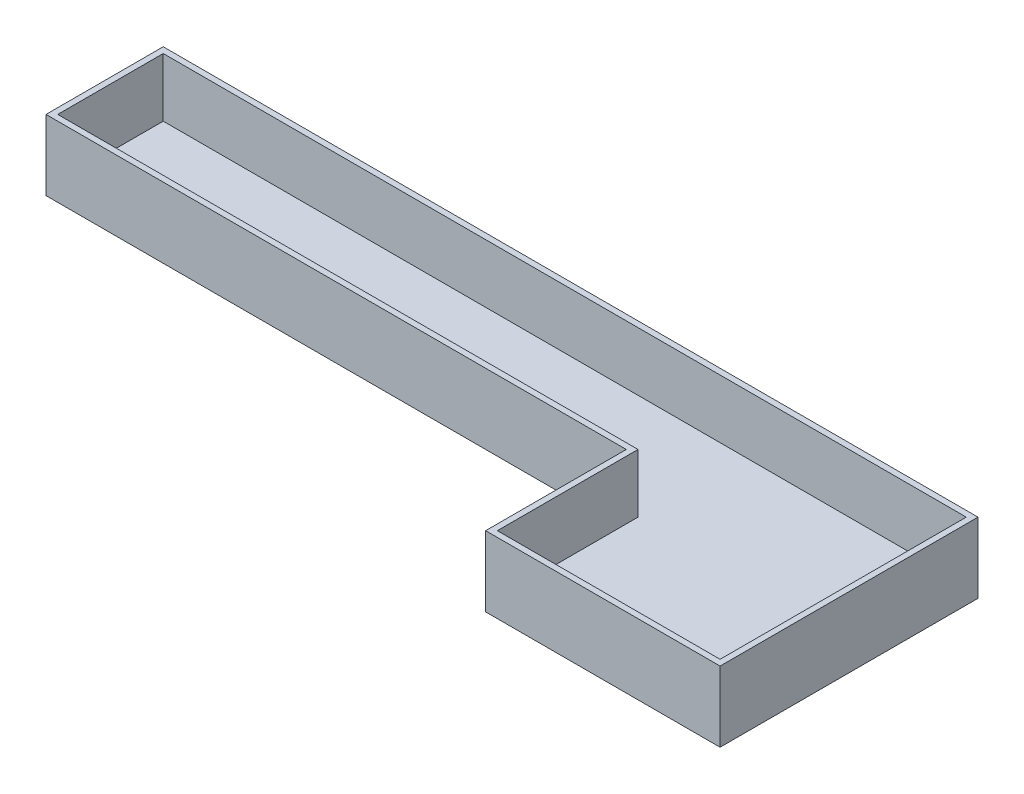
ISO-10303-21;
HEADER;
FILE_DESCRIPTION(('STEP AP214'),'2;1');
FILE_NAME('part.step','',(''),(''),'','','');
FILE_SCHEMA(('AUTOMOTIVE_DESIGN { 1 0 10303 214 1 1 1 1 }'));
ENDSEC;
DATA;
#1=APPLICATION_CONTEXT('core data for automotive mechanical design processes');
#2=APPLICATION_PROTOCOL_DEFINITION('international standard','automotive_design',2000,#1);
#3=PRODUCT_CONTEXT('',#1,'mechanical');
#4=PRODUCT('Part','Part','',(#3));
#5=PRODUCT_RELATED_PRODUCT_CATEGORY('part','',(#4));
#6=PRODUCT_DEFINITION_FORMATION('','',#4);
#7=PRODUCT_DEFINITION_CONTEXT('part definition',#1,'design');
#8=PRODUCT_DEFINITION('design','',#6,#7);
#9=PRODUCT_DEFINITION_SHAPE('','',#8);
#10=(LENGTH_UNIT() NAMED_UNIT(*) SI_UNIT(.MILLI.,.METRE.));
#11=(NAMED_UNIT(*) PLANE_ANGLE_UNIT() SI_UNIT($,.RADIAN.));
#12=(NAMED_UNIT(*) SI_UNIT($,.STERADIAN.) SOLID_ANGLE_UNIT());
#13=UNCERTAINTY_MEASURE_WITH_UNIT(LENGTH_MEASURE(1.E-05),#10,'distance_accuracy_value','');
#14=(GEOMETRIC_REPRESENTATION_CONTEXT(3) GLOBAL_UNCERTAINTY_ASSIGNED_CONTEXT((#13)) GLOBAL_UNIT_ASSIGNED_CONTEXT((#10,
#11,#12)) REPRESENTATION_CONTEXT('',''));
#15=CARTESIAN_POINT('',(0.,0.,0.));
#16=DIRECTION('',(0.,0.,1.));
#17=DIRECTION('',(1.,0.,0.));
#18=AXIS2_PLACEMENT_3D('',#15,#16,#17);
#19=CARTESIAN_POINT('',(0.,76.2,0.));
#20=DIRECTION('',(-1.,0.,0.));
#21=DIRECTION('',(0.,0.,1.));
#22=AXIS2_PLACEMENT_3D('',#19,#20,#21);
#23=PLANE('',#22);
#24=DIRECTION('',(0.,0.,-1.));
#25=VECTOR('',#24,1.);
#26=CARTESIAN_POINT('',(0.,-76.2,0.));
#27=LINE('',#26,#25);
#28=CARTESIAN_POINT('',(0.,-76.2,0.));
#29=VERTEX_POINT('',#28);
#30=CARTESIAN_POINT('',(0.,-76.2,-254.));
#31=VERTEX_POINT('',#30);
#32=EDGE_CURVE('E136',#29,#31,#27,.T.);
#33=ORIENTED_EDGE('',*,*,#32,.F.);
#34=DIRECTION('',(0.,-1.,0.));
#35=VECTOR('',#34,1.);
#36=CARTESIAN_POINT('',(0.,76.2,0.));
#37=LINE('',#36,#35);
#38=CARTESIAN_POINT('',(0.,76.2,0.));
#39=VERTEX_POINT('',#38);
#40=EDGE_CURVE('E11',#39,#29,#37,.T.);
#41=ORIENTED_EDGE('',*,*,#40,.F.);
#42=DIRECTION('',(0.,0.,-1.));
#43=VECTOR('',#42,1.);
#44=CARTESIAN_POINT('',(0.,76.2,0.));
#45=LINE('',#44,#43);
#46=CARTESIAN_POINT('',(0.,76.2,-254.));
#47=VERTEX_POINT('',#46);
#48=EDGE_CURVE('E151',#39,#47,#45,.T.);
#49=ORIENTED_EDGE('',*,*,#48,.T.);
#50=DIRECTION('',(0.,-1.,0.));
#51=VECTOR('',#50,1.);
#52=CARTESIAN_POINT('',(0.,76.2,-254.));
#53=LINE('',#52,#51);
#54=EDGE_CURVE('E41',#47,#31,#53,.T.);
#55=ORIENTED_EDGE('',*,*,#54,.T.);
#56=EDGE_LOOP('',(#33,#41,#49,#55));
#57=FACE_BOUND('',#56,.T.);
#58=ADVANCED_FACE('F38',(#57),#23,.T.);
#59=CARTESIAN_POINT('',(1257.3,76.2,0.));
#60=DIRECTION('',(0.,0.,1.));
#61=DIRECTION('',(1.,0.,0.));
#62=AXIS2_PLACEMENT_3D('',#59,#60,#61);
#63=PLANE('',#62);
#64=DIRECTION('',(-1.,0.,0.));
#65=VECTOR('',#64,1.);
#66=CARTESIAN_POINT('',(1257.3,-76.2,0.));
#67=LINE('',#66,#65);
#68=CARTESIAN_POINT('',(1257.3,-76.2,0.));
#69=VERTEX_POINT('',#68);
#70=EDGE_CURVE('E149',#69,#29,#67,.T.);
#71=ORIENTED_EDGE('',*,*,#70,.F.);
#72=DIRECTION('',(0.,-1.,0.));
#73=VECTOR('',#72,1.);
#74=CARTESIAN_POINT('',(1257.3,76.2,0.));
#75=LINE('',#74,#73);
#76=CARTESIAN_POINT('',(1257.3,76.2,0.));
#77=VERTEX_POINT('',#76);
#78=EDGE_CURVE('E46',#77,#69,#75,.T.);
#79=ORIENTED_EDGE('',*,*,#78,.F.);
#80=DIRECTION('',(-1.,0.,0.));
#81=VECTOR('',#80,1.);
#82=CARTESIAN_POINT('',(1257.3,76.2,0.));
#83=LINE('',#82,#81);
#84=EDGE_CURVE('E126',#77,#39,#83,.T.);
#85=ORIENTED_EDGE('',*,*,#84,.T.);
#86=ORIENTED_EDGE('',*,*,#40,.T.);
#87=EDGE_LOOP('',(#71,#79,#85,#86));
#88=FACE_BOUND('',#87,.T.);
#89=ADVANCED_FACE('F159',(#88),#63,.T.);
#90=CARTESIAN_POINT('',(1257.3,76.2,304.8));
#91=DIRECTION('',(-1.,0.,0.));
#92=DIRECTION('',(0.,0.,1.));
#93=AXIS2_PLACEMENT_3D('',#90,#91,#92);
#94=PLANE('',#93);
#95=DIRECTION('',(0.,0.,-1.));
#96=VECTOR('',#95,1.);
#97=CARTESIAN_POINT('',(1257.3,-76.2,304.8));
#98=LINE('',#97,#96);
#99=CARTESIAN_POINT('',(1257.3,-76.2,304.8));
#100=VERTEX_POINT('',#99);
#101=EDGE_CURVE('E113',#100,#69,#98,.T.);
#102=ORIENTED_EDGE('',*,*,#101,.F.);
#103=DIRECTION('',(0.,-1.,0.));
#104=VECTOR('',#103,1.);
#105=CARTESIAN_POINT('',(1257.3,76.2,304.8));
#106=LINE('',#105,#104);
#107=CARTESIAN_POINT('',(1257.3,76.2,304.8));
#108=VERTEX_POINT('',#107);
#109=EDGE_CURVE('E107',#108,#100,#106,.T.);
#110=ORIENTED_EDGE('',*,*,#109,.F.);
#111=DIRECTION('',(0.,0.,-1.));
#112=VECTOR('',#111,1.);
#113=CARTESIAN_POINT('',(1257.3,76.2,304.8));
#114=LINE('',#113,#112);
#115=EDGE_CURVE('E110',#108,#77,#114,.T.);
#116=ORIENTED_EDGE('',*,*,#115,.T.);
#117=ORIENTED_EDGE('',*,*,#78,.T.);
#118=EDGE_LOOP('',(#102,#110,#116,#117));
#119=FACE_BOUND('',#118,.T.);
#120=ADVANCED_FACE('F109',(#119),#94,.T.);
#121=CARTESIAN_POINT('',(1765.3,76.2,304.8));
#122=DIRECTION('',(0.,0.,1.));
#123=DIRECTION('',(1.,0.,0.));
#124=AXIS2_PLACEMENT_3D('',#121,#122,#123);
#125=PLANE('',#124);
#126=DIRECTION('',(-1.,0.,0.));
#127=VECTOR('',#126,1.);
#128=CARTESIAN_POINT('',(1765.3,-76.2,304.8));
#129=LINE('',#128,#127);
#130=CARTESIAN_POINT('',(1765.3,-76.2,304.8));
#131=VERTEX_POINT('',#130);
#132=EDGE_CURVE('E146',#131,#100,#129,.T.);
#133=ORIENTED_EDGE('',*,*,#132,.F.);
#134=DIRECTION('',(0.,-1.,0.));
#135=VECTOR('',#134,1.);
#136=CARTESIAN_POINT('',(1765.3,76.2,304.8));
#137=LINE('',#136,#135);
#138=CARTESIAN_POINT('',(1765.3,76.2,304.8));
#139=VERTEX_POINT('',#138);
#140=EDGE_CURVE('E118',#139,#131,#137,.T.);
#141=ORIENTED_EDGE('',*,*,#140,.F.);
#142=DIRECTION('',(-1.,0.,0.));
#143=VECTOR('',#142,1.);
#144=CARTESIAN_POINT('',(1765.3,76.2,304.8));
#145=LINE('',#144,#143);
#146=EDGE_CURVE('E124',#139,#108,#145,.T.);
#147=ORIENTED_EDGE('',*,*,#146,.T.);
#148=ORIENTED_EDGE('',*,*,#109,.T.);
#149=EDGE_LOOP('',(#133,#141,#147,#148));
#150=FACE_BOUND('',#149,.T.);
#151=ADVANCED_FACE('F128',(#150),#125,.T.);
#152=CARTESIAN_POINT('',(1765.3,76.2,-254.));
#153=DIRECTION('',(1.,0.,0.));
#154=DIRECTION('',(0.,0.,-1.));
#155=AXIS2_PLACEMENT_3D('',#152,#153,#154);
#156=PLANE('',#155);
#157=DIRECTION('',(0.,0.,1.));
#158=VECTOR('',#157,1.);
#159=CARTESIAN_POINT('',(1765.3,-76.2,-254.));
#160=LINE('',#159,#158);
#161=CARTESIAN_POINT('',(1765.3,-76.2,-254.));
#162=VERTEX_POINT('',#161);
#163=EDGE_CURVE('E143',#162,#131,#160,.T.);
#164=ORIENTED_EDGE('',*,*,#163,.F.);
#165=DIRECTION('',(0.,-1.,0.));
#166=VECTOR('',#165,1.);
#167=CARTESIAN_POINT('',(1765.3,76.2,-254.));
#168=LINE('',#167,#166);
#169=CARTESIAN_POINT('',(1765.3,76.2,-254.));
#170=VERTEX_POINT('',#169);
#171=EDGE_CURVE('E154',#170,#162,#168,.T.);
#172=ORIENTED_EDGE('',*,*,#171,.F.);
#173=DIRECTION('',(0.,0.,1.));
#174=VECTOR('',#173,1.);
#175=CARTESIAN_POINT('',(1765.3,76.2,-254.));
#176=LINE('',#175,#174);
#177=EDGE_CURVE('E129',#170,#139,#176,.T.);
#178=ORIENTED_EDGE('',*,*,#177,.T.);
#179=ORIENTED_EDGE('',*,*,#140,.T.);
#180=EDGE_LOOP('',(#164,#172,#178,#179));
#181=FACE_BOUND('',#180,.T.);
#182=ADVANCED_FACE('F172',(#181),#156,.T.);
#183=CARTESIAN_POINT('',(0.,76.2,-254.));
#184=DIRECTION('',(0.,0.,-1.));
#185=DIRECTION('',(-1.,0.,0.));
#186=AXIS2_PLACEMENT_3D('',#183,#184,#185);
#187=PLANE('',#186);
#188=DIRECTION('',(1.,0.,0.));
#189=VECTOR('',#188,1.);
#190=CARTESIAN_POINT('',(0.,-76.2,-254.));
#191=LINE('',#190,#189);
#192=EDGE_CURVE('E139',#31,#162,#191,.T.);
#193=ORIENTED_EDGE('',*,*,#192,.F.);
#194=ORIENTED_EDGE('',*,*,#54,.F.);
#195=DIRECTION('',(1.,0.,0.));
#196=VECTOR('',#195,1.);
#197=CARTESIAN_POINT('',(0.,76.2,-254.));
#198=LINE('',#197,#196);
#199=EDGE_CURVE('E131',#47,#170,#198,.T.);
#200=ORIENTED_EDGE('',*,*,#199,.T.);
#201=ORIENTED_EDGE('',*,*,#171,.T.);
#202=EDGE_LOOP('',(#193,#194,#200,#201));
#203=FACE_BOUND('',#202,.T.);
#204=ADVANCED_FACE('F156',(#203),#187,.T.);
#205=CARTESIAN_POINT('',(0.,76.2,0.));
#206=DIRECTION('',(0.,-1.,0.));
#207=DIRECTION('',(0.,0.,-1.));
#208=AXIS2_PLACEMENT_3D('',#205,#206,#207);
#209=PLANE('',#208);
#210=DIRECTION('',(0.,0.,1.));
#211=VECTOR('',#210,1.);
#212=CARTESIAN_POINT('',(1270.,76.2,292.1));
#213=LINE('',#212,#211);
#214=CARTESIAN_POINT('',(1270.,76.2,-12.7));
#215=VERTEX_POINT('',#214);
#216=CARTESIAN_POINT('',(1270.,76.2,292.1));
#217=VERTEX_POINT('',#216);
#218=EDGE_CURVE('E244',#215,#217,#213,.T.);
#219=ORIENTED_EDGE('',*,*,#218,.F.);
#220=DIRECTION('',(1.,0.,0.));
#221=VECTOR('',#220,1.);
#222=CARTESIAN_POINT('',(12.7,76.2,-12.7));
#223=LINE('',#222,#221);
#224=CARTESIAN_POINT('',(12.7,76.2,-12.7));
#225=VERTEX_POINT('',#224);
#226=EDGE_CURVE('E54',#225,#215,#223,.T.);
#227=ORIENTED_EDGE('',*,*,#226,.F.);
#228=DIRECTION('',(0.,0.,1.));
#229=VECTOR('',#228,1.);
#230=CARTESIAN_POINT('',(12.7,76.2,-12.7));
#231=LINE('',#230,#229);
#232=CARTESIAN_POINT('',(12.7,76.2,-241.3));
#233=VERTEX_POINT('',#232);
#234=EDGE_CURVE('E227',#233,#225,#231,.T.);
#235=ORIENTED_EDGE('',*,*,#234,.F.);
#236=DIRECTION('',(-1.,0.,0.));
#237=VECTOR('',#236,1.);
#238=CARTESIAN_POINT('',(12.7,76.2,-241.3));
#239=LINE('',#238,#237);
#240=CARTESIAN_POINT('',(1752.6,76.2,-241.3));
#241=VERTEX_POINT('',#240);
#242=EDGE_CURVE('E232',#241,#233,#239,.T.);
#243=ORIENTED_EDGE('',*,*,#242,.F.);
#244=DIRECTION('',(0.,0.,-1.));
#245=VECTOR('',#244,1.);
#246=CARTESIAN_POINT('',(1752.6,76.2,-241.3));
#247=LINE('',#246,#245);
#248=CARTESIAN_POINT('',(1752.6,76.2,292.1));
#249=VERTEX_POINT('',#248);
#250=EDGE_CURVE('E250',#249,#241,#247,.T.);
#251=ORIENTED_EDGE('',*,*,#250,.F.);
#252=DIRECTION('',(1.,0.,0.));
#253=VECTOR('',#252,1.);
#254=CARTESIAN_POINT('',(1752.6,76.2,292.1));
#255=LINE('',#254,#253);
#256=EDGE_CURVE('E247',#217,#249,#255,.T.);
#257=ORIENTED_EDGE('',*,*,#256,.F.);
#258=EDGE_LOOP('',(#219,#227,#235,#243,#251,#257));
#259=FACE_BOUND('',#258,.T.);
#260=ORIENTED_EDGE('',*,*,#48,.F.);
#261=ORIENTED_EDGE('',*,*,#84,.F.);
#262=ORIENTED_EDGE('',*,*,#115,.F.);
#263=ORIENTED_EDGE('',*,*,#146,.F.);
#264=ORIENTED_EDGE('',*,*,#177,.F.);
#265=ORIENTED_EDGE('',*,*,#199,.F.);
#266=EDGE_LOOP('',(#260,#261,#262,#263,#264,#265));
#267=FACE_BOUND('',#266,.T.);
#268=ADVANCED_FACE('F122',(#259,#267),#209,.F.);
#269=CARTESIAN_POINT('',(0.,-76.2,0.));
#270=DIRECTION('',(0.,-1.,0.));
#271=DIRECTION('',(0.,0.,-1.));
#272=AXIS2_PLACEMENT_3D('',#269,#270,#271);
#273=PLANE('',#272);
#274=ORIENTED_EDGE('',*,*,#32,.T.);
#275=ORIENTED_EDGE('',*,*,#192,.T.);
#276=ORIENTED_EDGE('',*,*,#163,.T.);
#277=ORIENTED_EDGE('',*,*,#132,.T.);
#278=ORIENTED_EDGE('',*,*,#101,.T.);
#279=ORIENTED_EDGE('',*,*,#70,.T.);
#280=EDGE_LOOP('',(#274,#275,#276,#277,#278,#279));
#281=FACE_BOUND('',#280,.T.);
#282=ADVANCED_FACE('F158',(#281),#273,.T.);
#283=CARTESIAN_POINT('',(12.7,-50.8,-12.7));
#284=DIRECTION('',(0.,0.,1.));
#285=DIRECTION('',(1.,0.,0.));
#286=AXIS2_PLACEMENT_3D('',#283,#284,#285);
#287=PLANE('',#286);
#288=ORIENTED_EDGE('',*,*,#226,.T.);
#289=DIRECTION('',(0.,1.,0.));
#290=VECTOR('',#289,1.);
#291=CARTESIAN_POINT('',(1270.,-50.8,-12.7));
#292=LINE('',#291,#290);
#293=CARTESIAN_POINT('',(1270.,-50.8,-12.7));
#294=VERTEX_POINT('',#293);
#295=EDGE_CURVE('E242',#294,#215,#292,.T.);
#296=ORIENTED_EDGE('',*,*,#295,.F.);
#297=DIRECTION('',(1.,0.,0.));
#298=VECTOR('',#297,1.);
#299=CARTESIAN_POINT('',(12.7,-50.8,-12.7));
#300=LINE('',#299,#298);
#301=CARTESIAN_POINT('',(12.7,-50.8,-12.7));
#302=VERTEX_POINT('',#301);
#303=EDGE_CURVE('E218',#302,#294,#300,.T.);
#304=ORIENTED_EDGE('',*,*,#303,.F.);
#305=DIRECTION('',(0.,1.,0.));
#306=VECTOR('',#305,1.);
#307=CARTESIAN_POINT('',(12.7,-50.8,-12.7));
#308=LINE('',#307,#306);
#309=EDGE_CURVE('E140',#302,#225,#308,.T.);
#310=ORIENTED_EDGE('',*,*,#309,.T.);
#311=EDGE_LOOP('',(#288,#296,#304,#310));
#312=FACE_BOUND('',#311,.T.);
#313=ADVANCED_FACE('F183',(#312),#287,.F.);
#314=CARTESIAN_POINT('',(12.7,-50.8,-12.7));
#315=DIRECTION('',(-1.,0.,0.));
#316=DIRECTION('',(0.,0.,1.));
#317=AXIS2_PLACEMENT_3D('',#314,#315,#316);
#318=PLANE('',#317);
#319=ORIENTED_EDGE('',*,*,#234,.T.);
#320=ORIENTED_EDGE('',*,*,#309,.F.);
#321=DIRECTION('',(0.,0.,1.));
#322=VECTOR('',#321,1.);
#323=CARTESIAN_POINT('',(12.7,-50.8,-12.7));
#324=LINE('',#323,#322);
#325=CARTESIAN_POINT('',(12.7,-50.8,-241.3));
#326=VERTEX_POINT('',#325);
#327=EDGE_CURVE('E225',#326,#302,#324,.T.);
#328=ORIENTED_EDGE('',*,*,#327,.F.);
#329=DIRECTION('',(0.,1.,0.));
#330=VECTOR('',#329,1.);
#331=CARTESIAN_POINT('',(12.7,-50.8,-241.3));
#332=LINE('',#331,#330);
#333=EDGE_CURVE('E256',#326,#233,#332,.T.);
#334=ORIENTED_EDGE('',*,*,#333,.T.);
#335=EDGE_LOOP('',(#319,#320,#328,#334));
#336=FACE_BOUND('',#335,.T.);
#337=ADVANCED_FACE('F188',(#336),#318,.F.);
#338=CARTESIAN_POINT('',(12.7,-50.8,-241.3));
#339=DIRECTION('',(0.,0.,-1.));
#340=DIRECTION('',(-1.,0.,0.));
#341=AXIS2_PLACEMENT_3D('',#338,#339,#340);
#342=PLANE('',#341);
#343=ORIENTED_EDGE('',*,*,#242,.T.);
#344=ORIENTED_EDGE('',*,*,#333,.F.);
#345=DIRECTION('',(-1.,0.,0.));
#346=VECTOR('',#345,1.);
#347=CARTESIAN_POINT('',(12.7,-50.8,-241.3));
#348=LINE('',#347,#346);
#349=CARTESIAN_POINT('',(1752.6,-50.8,-241.3));
#350=VERTEX_POINT('',#349);
#351=EDGE_CURVE('E239',#350,#326,#348,.T.);
#352=ORIENTED_EDGE('',*,*,#351,.F.);
#353=DIRECTION('',(0.,1.,0.));
#354=VECTOR('',#353,1.);
#355=CARTESIAN_POINT('',(1752.6,-50.8,-241.3));
#356=LINE('',#355,#354);
#357=EDGE_CURVE('E259',#350,#241,#356,.T.);
#358=ORIENTED_EDGE('',*,*,#357,.T.);
#359=EDGE_LOOP('',(#343,#344,#352,#358));
#360=FACE_BOUND('',#359,.T.);
#361=ADVANCED_FACE('F201',(#360),#342,.F.);
#362=CARTESIAN_POINT('',(1752.6,-50.8,-241.3));
#363=DIRECTION('',(1.,0.,0.));
#364=DIRECTION('',(0.,0.,-1.));
#365=AXIS2_PLACEMENT_3D('',#362,#363,#364);
#366=PLANE('',#365);
#367=ORIENTED_EDGE('',*,*,#250,.T.);
#368=ORIENTED_EDGE('',*,*,#357,.F.);
#369=DIRECTION('',(0.,0.,-1.));
#370=VECTOR('',#369,1.);
#371=CARTESIAN_POINT('',(1752.6,-50.8,-241.3));
#372=LINE('',#371,#370);
#373=CARTESIAN_POINT('',(1752.6,-50.8,292.1));
#374=VERTEX_POINT('',#373);
#375=EDGE_CURVE('E236',#374,#350,#372,.T.);
#376=ORIENTED_EDGE('',*,*,#375,.F.);
#377=DIRECTION('',(0.,1.,0.));
#378=VECTOR('',#377,1.);
#379=CARTESIAN_POINT('',(1752.6,-50.8,292.1));
#380=LINE('',#379,#378);
#381=EDGE_CURVE('E262',#374,#249,#380,.T.);
#382=ORIENTED_EDGE('',*,*,#381,.T.);
#383=EDGE_LOOP('',(#367,#368,#376,#382));
#384=FACE_BOUND('',#383,.T.);
#385=ADVANCED_FACE('F197',(#384),#366,.F.);
#386=CARTESIAN_POINT('',(1752.6,-50.8,292.1));
#387=DIRECTION('',(0.,0.,1.));
#388=DIRECTION('',(1.,0.,0.));
#389=AXIS2_PLACEMENT_3D('',#386,#387,#388);
#390=PLANE('',#389);
#391=ORIENTED_EDGE('',*,*,#256,.T.);
#392=ORIENTED_EDGE('',*,*,#381,.F.);
#393=DIRECTION('',(1.,0.,0.));
#394=VECTOR('',#393,1.);
#395=CARTESIAN_POINT('',(1752.6,-50.8,292.1));
#396=LINE('',#395,#394);
#397=CARTESIAN_POINT('',(1270.,-50.8,292.1));
#398=VERTEX_POINT('',#397);
#399=EDGE_CURVE('E229',#398,#374,#396,.T.);
#400=ORIENTED_EDGE('',*,*,#399,.F.);
#401=DIRECTION('',(0.,1.,0.));
#402=VECTOR('',#401,1.);
#403=CARTESIAN_POINT('',(1270.,-50.8,292.1));
#404=LINE('',#403,#402);
#405=EDGE_CURVE('E265',#398,#217,#404,.T.);
#406=ORIENTED_EDGE('',*,*,#405,.T.);
#407=EDGE_LOOP('',(#391,#392,#400,#406));
#408=FACE_BOUND('',#407,.T.);
#409=ADVANCED_FACE('F193',(#408),#390,.F.);
#410=CARTESIAN_POINT('',(1270.,-50.8,292.1));
#411=DIRECTION('',(-1.,0.,0.));
#412=DIRECTION('',(0.,0.,1.));
#413=AXIS2_PLACEMENT_3D('',#410,#411,#412);
#414=PLANE('',#413);
#415=ORIENTED_EDGE('',*,*,#218,.T.);
#416=ORIENTED_EDGE('',*,*,#405,.F.);
#417=DIRECTION('',(0.,0.,1.));
#418=VECTOR('',#417,1.);
#419=CARTESIAN_POINT('',(1270.,-50.8,292.1));
#420=LINE('',#419,#418);
#421=EDGE_CURVE('E222',#294,#398,#420,.T.);
#422=ORIENTED_EDGE('',*,*,#421,.F.);
#423=ORIENTED_EDGE('',*,*,#295,.T.);
#424=EDGE_LOOP('',(#415,#416,#422,#423));
#425=FACE_BOUND('',#424,.T.);
#426=ADVANCED_FACE('F189',(#425),#414,.F.);
#427=CARTESIAN_POINT('',(0.,-50.8,0.));
#428=DIRECTION('',(0.,1.,0.));
#429=DIRECTION('',(0.,0.,1.));
#430=AXIS2_PLACEMENT_3D('',#427,#428,#429);
#431=PLANE('',#430);
#432=ORIENTED_EDGE('',*,*,#303,.T.);
#433=ORIENTED_EDGE('',*,*,#421,.T.);
#434=ORIENTED_EDGE('',*,*,#399,.T.);
#435=ORIENTED_EDGE('',*,*,#375,.T.);
#436=ORIENTED_EDGE('',*,*,#351,.T.);
#437=ORIENTED_EDGE('',*,*,#327,.T.);
#438=EDGE_LOOP('',(#432,#433,#434,#435,#436,#437));
#439=FACE_BOUND('',#438,.T.);
#440=ADVANCED_FACE('F192',(#439),#431,.T.);
#441=CLOSED_SHELL('',(#58,#89,#120,#151,#182,#204,#268,#282,#313,#337,#361,#385,#409,#426,#440));
#442=MANIFOLD_SOLID_BREP('B2',#441);
#443=ADVANCED_BREP_SHAPE_REPRESENTATION('',(#18,#442),#14);
#444=SHAPE_DEFINITION_REPRESENTATION(#9,#443);
ENDSEC;
END-ISO-10303-21;
